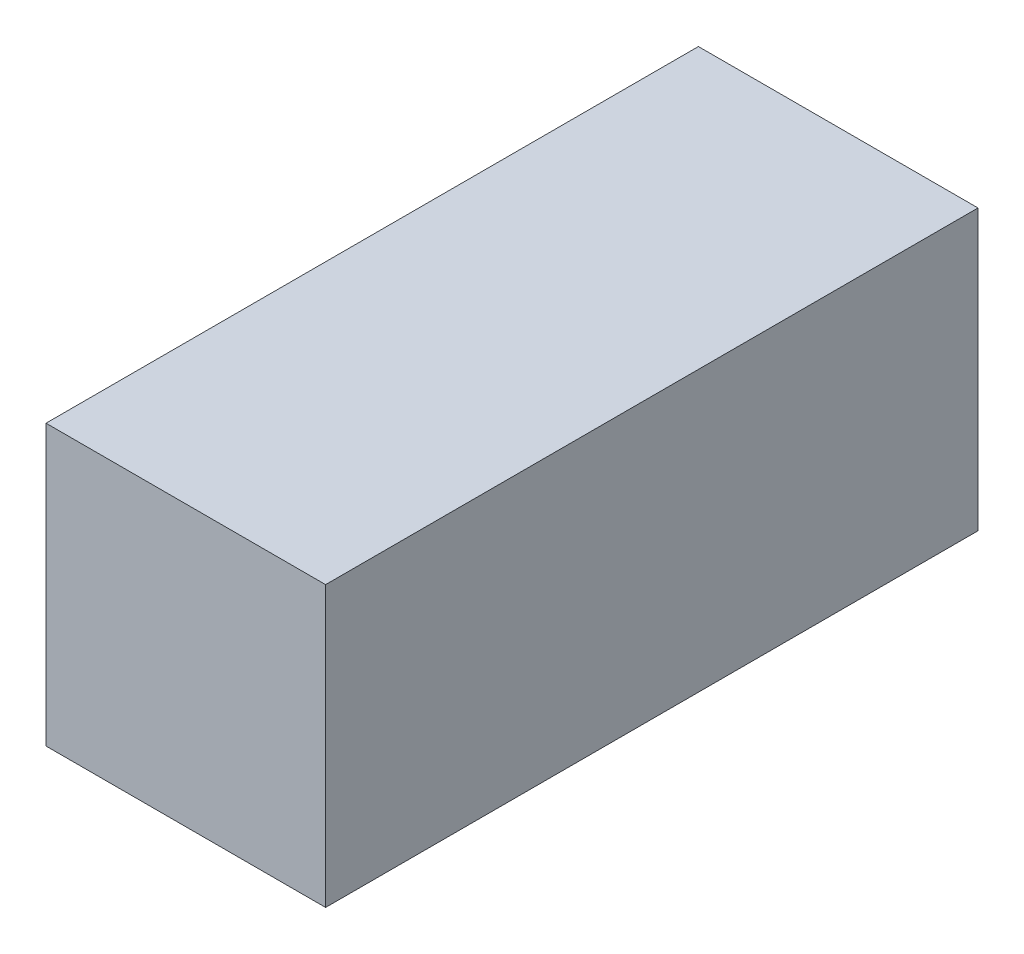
ISO-10303-21;
HEADER;
FILE_DESCRIPTION(('STEP AP214'),'2;1');
FILE_NAME('part.step','',(''),(''),'','','');
FILE_SCHEMA(('AUTOMOTIVE_DESIGN { 1 0 10303 214 1 1 1 1 }'));
ENDSEC;
DATA;
#1=APPLICATION_CONTEXT('core data for automotive mechanical design processes');
#2=APPLICATION_PROTOCOL_DEFINITION('international standard','automotive_design',2000,#1);
#3=PRODUCT_CONTEXT('',#1,'mechanical');
#4=PRODUCT('Part','Part','',(#3));
#5=PRODUCT_RELATED_PRODUCT_CATEGORY('part','',(#4));
#6=PRODUCT_DEFINITION_FORMATION('','',#4);
#7=PRODUCT_DEFINITION_CONTEXT('part definition',#1,'design');
#8=PRODUCT_DEFINITION('design','',#6,#7);
#9=PRODUCT_DEFINITION_SHAPE('','',#8);
#10=(LENGTH_UNIT() NAMED_UNIT(*) SI_UNIT(.MILLI.,.METRE.));
#11=(NAMED_UNIT(*) PLANE_ANGLE_UNIT() SI_UNIT($,.RADIAN.));
#12=(NAMED_UNIT(*) SI_UNIT($,.STERADIAN.) SOLID_ANGLE_UNIT());
#13=UNCERTAINTY_MEASURE_WITH_UNIT(LENGTH_MEASURE(1.E-05),#10,'distance_accuracy_value','');
#14=(GEOMETRIC_REPRESENTATION_CONTEXT(3) GLOBAL_UNCERTAINTY_ASSIGNED_CONTEXT((#13)) GLOBAL_UNIT_ASSIGNED_CONTEXT((#10,
#11,#12)) REPRESENTATION_CONTEXT('',''));
#15=CARTESIAN_POINT('',(0.,0.,0.));
#16=DIRECTION('',(0.,0.,1.));
#17=DIRECTION('',(1.,0.,0.));
#18=AXIS2_PLACEMENT_3D('',#15,#16,#17);
#19=CARTESIAN_POINT('',(0.,0.,7.));
#20=DIRECTION('',(1.,0.,0.));
#21=DIRECTION('',(0.,0.,-1.));
#22=AXIS2_PLACEMENT_3D('',#19,#20,#21);
#23=PLANE('',#22);
#24=DIRECTION('',(0.,-1.,0.));
#25=VECTOR('',#24,1.);
#26=CARTESIAN_POINT('',(0.,0.,0.));
#27=LINE('',#26,#25);
#28=CARTESIAN_POINT('',(0.,2.99999999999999,0.));
#29=VERTEX_POINT('',#28);
#30=CARTESIAN_POINT('',(0.,0.,0.));
#31=VERTEX_POINT('',#30);
#32=EDGE_CURVE('E71',#29,#31,#27,.T.);
#33=ORIENTED_EDGE('',*,*,#32,.T.);
#34=DIRECTION('',(0.,0.,-1.));
#35=VECTOR('',#34,1.);
#36=CARTESIAN_POINT('',(0.,0.,7.));
#37=LINE('',#36,#35);
#38=CARTESIAN_POINT('',(0.,0.,7.));
#39=VERTEX_POINT('',#38);
#40=EDGE_CURVE('E11',#39,#31,#37,.T.);
#41=ORIENTED_EDGE('',*,*,#40,.F.);
#42=DIRECTION('',(0.,-1.,0.));
#43=VECTOR('',#42,1.);
#44=CARTESIAN_POINT('',(0.,0.,7.));
#45=LINE('',#44,#43);
#46=CARTESIAN_POINT('',(0.,2.99999999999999,7.));
#47=VERTEX_POINT('',#46);
#48=EDGE_CURVE('E89',#47,#39,#45,.T.);
#49=ORIENTED_EDGE('',*,*,#48,.F.);
#50=DIRECTION('',(0.,0.,-1.));
#51=VECTOR('',#50,1.);
#52=CARTESIAN_POINT('',(0.,2.99999999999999,7.));
#53=LINE('',#52,#51);
#54=EDGE_CURVE('E83',#47,#29,#53,.T.);
#55=ORIENTED_EDGE('',*,*,#54,.T.);
#56=EDGE_LOOP('',(#33,#41,#49,#55));
#57=FACE_BOUND('',#56,.T.);
#58=ADVANCED_FACE('F27',(#57),#23,.F.);
#59=CARTESIAN_POINT('',(0.,0.,7.));
#60=DIRECTION('',(0.,1.,0.));
#61=DIRECTION('',(0.,0.,1.));
#62=AXIS2_PLACEMENT_3D('',#59,#60,#61);
#63=PLANE('',#62);
#64=DIRECTION('',(1.,0.,0.));
#65=VECTOR('',#64,1.);
#66=CARTESIAN_POINT('',(0.,0.,0.));
#67=LINE('',#66,#65);
#68=CARTESIAN_POINT('',(2.99999999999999,0.,0.));
#69=VERTEX_POINT('',#68);
#70=EDGE_CURVE('E67',#31,#69,#67,.T.);
#71=ORIENTED_EDGE('',*,*,#70,.T.);
#72=DIRECTION('',(0.,0.,-1.));
#73=VECTOR('',#72,1.);
#74=CARTESIAN_POINT('',(2.99999999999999,0.,7.));
#75=LINE('',#74,#73);
#76=CARTESIAN_POINT('',(2.99999999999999,0.,7.));
#77=VERTEX_POINT('',#76);
#78=EDGE_CURVE('E34',#77,#69,#75,.T.);
#79=ORIENTED_EDGE('',*,*,#78,.F.);
#80=DIRECTION('',(1.,0.,0.));
#81=VECTOR('',#80,1.);
#82=CARTESIAN_POINT('',(0.,0.,7.));
#83=LINE('',#82,#81);
#84=EDGE_CURVE('E79',#39,#77,#83,.T.);
#85=ORIENTED_EDGE('',*,*,#84,.F.);
#86=ORIENTED_EDGE('',*,*,#40,.T.);
#87=EDGE_LOOP('',(#71,#79,#85,#86));
#88=FACE_BOUND('',#87,.T.);
#89=ADVANCED_FACE('F78',(#88),#63,.F.);
#90=CARTESIAN_POINT('',(2.99999999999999,0.,7.));
#91=DIRECTION('',(-1.,0.,0.));
#92=DIRECTION('',(0.,0.,1.));
#93=AXIS2_PLACEMENT_3D('',#90,#91,#92);
#94=PLANE('',#93);
#95=DIRECTION('',(0.,1.,0.));
#96=VECTOR('',#95,1.);
#97=CARTESIAN_POINT('',(2.99999999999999,0.,0.));
#98=LINE('',#97,#96);
#99=CARTESIAN_POINT('',(2.99999999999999,2.99999999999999,0.));
#100=VERTEX_POINT('',#99);
#101=EDGE_CURVE('E72',#69,#100,#98,.T.);
#102=ORIENTED_EDGE('',*,*,#101,.T.);
#103=DIRECTION('',(0.,0.,-1.));
#104=VECTOR('',#103,1.);
#105=CARTESIAN_POINT('',(2.99999999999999,2.99999999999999,7.));
#106=LINE('',#105,#104);
#107=CARTESIAN_POINT('',(2.99999999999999,2.99999999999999,7.));
#108=VERTEX_POINT('',#107);
#109=EDGE_CURVE('E95',#108,#100,#106,.T.);
#110=ORIENTED_EDGE('',*,*,#109,.F.);
#111=DIRECTION('',(0.,1.,0.));
#112=VECTOR('',#111,1.);
#113=CARTESIAN_POINT('',(2.99999999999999,0.,7.));
#114=LINE('',#113,#112);
#115=EDGE_CURVE('E46',#77,#108,#114,.T.);
#116=ORIENTED_EDGE('',*,*,#115,.F.);
#117=ORIENTED_EDGE('',*,*,#78,.T.);
#118=EDGE_LOOP('',(#102,#110,#116,#117));
#119=FACE_BOUND('',#118,.T.);
#120=ADVANCED_FACE('F98',(#119),#94,.F.);
#121=CARTESIAN_POINT('',(0.,2.99999999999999,7.));
#122=DIRECTION('',(0.,-1.,0.));
#123=DIRECTION('',(0.,0.,-1.));
#124=AXIS2_PLACEMENT_3D('',#121,#122,#123);
#125=PLANE('',#124);
#126=DIRECTION('',(-1.,0.,0.));
#127=VECTOR('',#126,1.);
#128=CARTESIAN_POINT('',(0.,2.99999999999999,0.));
#129=LINE('',#128,#127);
#130=EDGE_CURVE('E87',#100,#29,#129,.T.);
#131=ORIENTED_EDGE('',*,*,#130,.T.);
#132=ORIENTED_EDGE('',*,*,#54,.F.);
#133=DIRECTION('',(-1.,0.,0.));
#134=VECTOR('',#133,1.);
#135=CARTESIAN_POINT('',(0.,2.99999999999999,7.));
#136=LINE('',#135,#134);
#137=EDGE_CURVE('E41',#108,#47,#136,.T.);
#138=ORIENTED_EDGE('',*,*,#137,.F.);
#139=ORIENTED_EDGE('',*,*,#109,.T.);
#140=EDGE_LOOP('',(#131,#132,#138,#139));
#141=FACE_BOUND('',#140,.T.);
#142=ADVANCED_FACE('F100',(#141),#125,.F.);
#143=CARTESIAN_POINT('',(0.,2.99999999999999,7.));
#144=DIRECTION('',(0.,0.,-1.));
#145=DIRECTION('',(-1.,0.,0.));
#146=AXIS2_PLACEMENT_3D('',#143,#144,#145);
#147=PLANE('',#146);
#148=ORIENTED_EDGE('',*,*,#48,.T.);
#149=ORIENTED_EDGE('',*,*,#84,.T.);
#150=ORIENTED_EDGE('',*,*,#115,.T.);
#151=ORIENTED_EDGE('',*,*,#137,.T.);
#152=EDGE_LOOP('',(#148,#149,#150,#151));
#153=FACE_BOUND('',#152,.T.);
#154=ADVANCED_FACE('F101',(#153),#147,.F.);
#155=CARTESIAN_POINT('',(0.,2.99999999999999,0.));
#156=DIRECTION('',(0.,0.,-1.));
#157=DIRECTION('',(-1.,0.,0.));
#158=AXIS2_PLACEMENT_3D('',#155,#156,#157);
#159=PLANE('',#158);
#160=ORIENTED_EDGE('',*,*,#32,.F.);
#161=ORIENTED_EDGE('',*,*,#130,.F.);
#162=ORIENTED_EDGE('',*,*,#101,.F.);
#163=ORIENTED_EDGE('',*,*,#70,.F.);
#164=EDGE_LOOP('',(#160,#161,#162,#163));
#165=FACE_BOUND('',#164,.T.);
#166=ADVANCED_FACE('F68',(#165),#159,.T.);
#167=CLOSED_SHELL('',(#58,#89,#120,#142,#154,#166));
#168=MANIFOLD_SOLID_BREP('B2',#167);
#169=ADVANCED_BREP_SHAPE_REPRESENTATION('',(#18,#168),#14);
#170=SHAPE_DEFINITION_REPRESENTATION(#9,#169);
ENDSEC;
END-ISO-10303-21;
